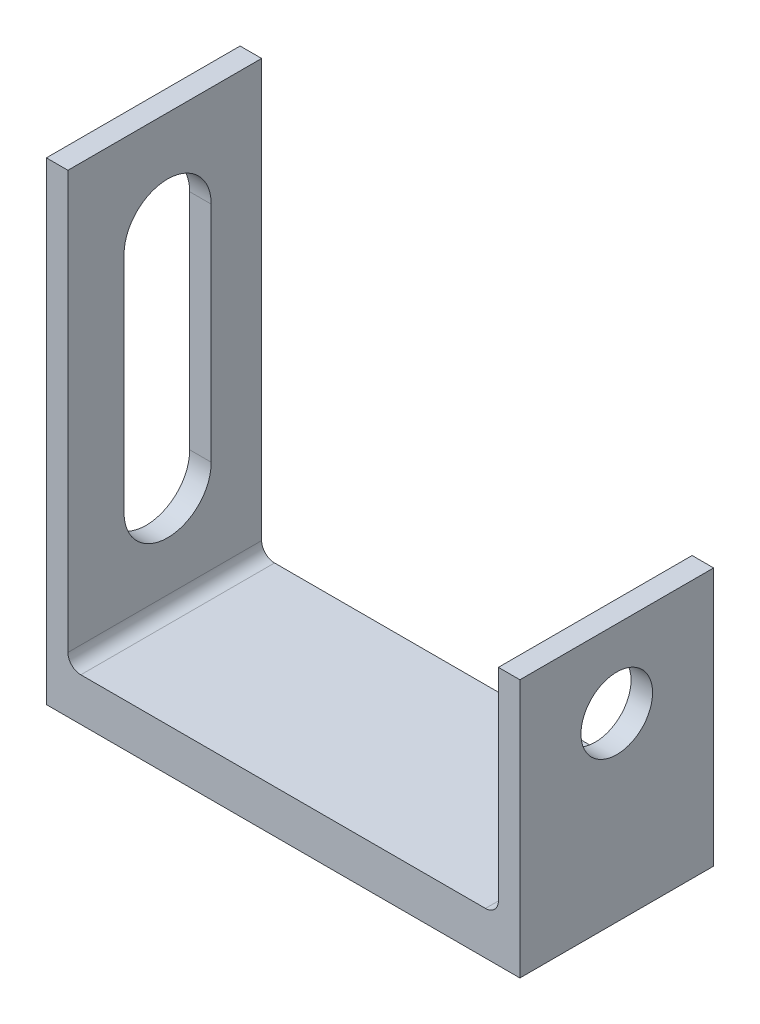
ISO-10303-21;
HEADER;
FILE_DESCRIPTION(('STEP AP214'),'2;1');
FILE_NAME('part.step','',(''),(''),'','','');
FILE_SCHEMA(('AUTOMOTIVE_DESIGN { 1 0 10303 214 1 1 1 1 }'));
ENDSEC;
DATA;
#1=APPLICATION_CONTEXT('core data for automotive mechanical design processes');
#2=APPLICATION_PROTOCOL_DEFINITION('international standard','automotive_design',2000,#1);
#3=PRODUCT_CONTEXT('',#1,'mechanical');
#4=PRODUCT('Part','Part','',(#3));
#5=PRODUCT_RELATED_PRODUCT_CATEGORY('part','',(#4));
#6=PRODUCT_DEFINITION_FORMATION('','',#4);
#7=PRODUCT_DEFINITION_CONTEXT('part definition',#1,'design');
#8=PRODUCT_DEFINITION('design','',#6,#7);
#9=PRODUCT_DEFINITION_SHAPE('','',#8);
#10=(LENGTH_UNIT() NAMED_UNIT(*) SI_UNIT(.MILLI.,.METRE.));
#11=(NAMED_UNIT(*) PLANE_ANGLE_UNIT() SI_UNIT($,.RADIAN.));
#12=(NAMED_UNIT(*) SI_UNIT($,.STERADIAN.) SOLID_ANGLE_UNIT());
#13=UNCERTAINTY_MEASURE_WITH_UNIT(LENGTH_MEASURE(1.E-05),#10,'distance_accuracy_value','');
#14=(GEOMETRIC_REPRESENTATION_CONTEXT(3) GLOBAL_UNCERTAINTY_ASSIGNED_CONTEXT((#13)) GLOBAL_UNIT_ASSIGNED_CONTEXT((#10,
#11,#12)) REPRESENTATION_CONTEXT('',''));
#15=CARTESIAN_POINT('',(0.,0.,0.));
#16=DIRECTION('',(0.,0.,1.));
#17=DIRECTION('',(1.,0.,0.));
#18=AXIS2_PLACEMENT_3D('',#15,#16,#17);
#19=CARTESIAN_POINT('',(0.,0.,0.));
#20=DIRECTION('',(0.,1.,0.));
#21=DIRECTION('',(0.,0.,1.));
#22=AXIS2_PLACEMENT_3D('',#19,#20,#21);
#23=PLANE('',#22);
#24=DIRECTION('',(1.,0.,0.));
#25=VECTOR('',#24,1.);
#26=CARTESIAN_POINT('',(0.,0.,0.));
#27=LINE('',#26,#25);
#28=CARTESIAN_POINT('',(8.00000000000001,0.,0.));
#29=VERTEX_POINT('',#28);
#30=CARTESIAN_POINT('',(102.,0.,0.));
#31=VERTEX_POINT('',#30);
#32=EDGE_CURVE('E211',#29,#31,#27,.T.);
#33=ORIENTED_EDGE('',*,*,#32,.T.);
#34=DIRECTION('',(0.,0.,1.));
#35=VECTOR('',#34,1.);
#36=CARTESIAN_POINT('',(102.,0.,0.));
#37=LINE('',#36,#35);
#38=CARTESIAN_POINT('',(102.,0.,-45.));
#39=VERTEX_POINT('',#38);
#40=EDGE_CURVE('E247',#31,#39,#37,.F.);
#41=ORIENTED_EDGE('',*,*,#40,.T.);
#42=DIRECTION('',(1.,0.,0.));
#43=VECTOR('',#42,1.);
#44=CARTESIAN_POINT('',(0.,0.,-45.));
#45=LINE('',#44,#43);
#46=CARTESIAN_POINT('',(8.,0.,-45.));
#47=VERTEX_POINT('',#46);
#48=EDGE_CURVE('E216',#47,#39,#45,.T.);
#49=ORIENTED_EDGE('',*,*,#48,.F.);
#50=DIRECTION('',(0.,0.,1.));
#51=VECTOR('',#50,1.);
#52=CARTESIAN_POINT('',(8.00000000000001,0.,0.));
#53=LINE('',#52,#51);
#54=EDGE_CURVE('E230',#47,#29,#53,.T.);
#55=ORIENTED_EDGE('',*,*,#54,.T.);
#56=EDGE_LOOP('',(#33,#41,#49,#55));
#57=FACE_BOUND('',#56,.T.);
#58=ADVANCED_FACE('F39',(#57),#23,.T.);
#59=CARTESIAN_POINT('',(0.,-10.,0.));
#60=DIRECTION('',(0.,0.,1.));
#61=DIRECTION('',(1.,0.,0.));
#62=AXIS2_PLACEMENT_3D('',#59,#60,#61);
#63=PLANE('',#62);
#64=ORIENTED_EDGE('',*,*,#32,.F.);
#65=CARTESIAN_POINT('',(8.00000000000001,3.,0.));
#66=DIRECTION('',(0.,0.,1.));
#67=DIRECTION('',(1.,0.,0.));
#68=AXIS2_PLACEMENT_3D('',#65,#66,#67);
#69=CIRCLE('',#68,3.);
#70=CARTESIAN_POINT('',(5.00000000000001,3.,0.));
#71=VERTEX_POINT('',#70);
#72=EDGE_CURVE('E240',#29,#71,#69,.F.);
#73=ORIENTED_EDGE('',*,*,#72,.T.);
#74=DIRECTION('',(0.,-1.,0.));
#75=VECTOR('',#74,1.);
#76=CARTESIAN_POINT('',(5.00000000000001,100.,0.));
#77=LINE('',#76,#75);
#78=CARTESIAN_POINT('',(5.00000000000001,100.,0.));
#79=VERTEX_POINT('',#78);
#80=EDGE_CURVE('E205',#79,#71,#77,.T.);
#81=ORIENTED_EDGE('',*,*,#80,.F.);
#82=DIRECTION('',(1.,0.,0.));
#83=VECTOR('',#82,1.);
#84=CARTESIAN_POINT('',(0.,100.,0.));
#85=LINE('',#84,#83);
#86=CARTESIAN_POINT('',(0.,100.,0.));
#87=VERTEX_POINT('',#86);
#88=EDGE_CURVE('E203',#87,#79,#85,.T.);
#89=ORIENTED_EDGE('',*,*,#88,.F.);
#90=DIRECTION('',(0.,1.,0.));
#91=VECTOR('',#90,1.);
#92=CARTESIAN_POINT('',(0.,-10.,0.));
#93=LINE('',#92,#91);
#94=CARTESIAN_POINT('',(0.,-10.,0.));
#95=VERTEX_POINT('',#94);
#96=EDGE_CURVE('E228',#95,#87,#93,.T.);
#97=ORIENTED_EDGE('',*,*,#96,.F.);
#98=DIRECTION('',(1.,0.,0.));
#99=VECTOR('',#98,1.);
#100=CARTESIAN_POINT('',(0.,-10.,0.));
#101=LINE('',#100,#99);
#102=CARTESIAN_POINT('',(110.,-10.,0.));
#103=VERTEX_POINT('',#102);
#104=EDGE_CURVE('E212',#95,#103,#101,.T.);
#105=ORIENTED_EDGE('',*,*,#104,.T.);
#106=DIRECTION('',(0.,1.,0.));
#107=VECTOR('',#106,1.);
#108=CARTESIAN_POINT('',(110.,-10.,0.));
#109=LINE('',#108,#107);
#110=CARTESIAN_POINT('',(110.,50.,0.));
#111=VERTEX_POINT('',#110);
#112=EDGE_CURVE('E223',#103,#111,#109,.T.);
#113=ORIENTED_EDGE('',*,*,#112,.T.);
#114=DIRECTION('',(1.,0.,0.));
#115=VECTOR('',#114,1.);
#116=CARTESIAN_POINT('',(0.,50.,0.));
#117=LINE('',#116,#115);
#118=CARTESIAN_POINT('',(105.,50.,0.));
#119=VERTEX_POINT('',#118);
#120=EDGE_CURVE('E182',#119,#111,#117,.T.);
#121=ORIENTED_EDGE('',*,*,#120,.F.);
#122=DIRECTION('',(0.,-1.,0.));
#123=VECTOR('',#122,1.);
#124=CARTESIAN_POINT('',(105.,50.,0.));
#125=LINE('',#124,#123);
#126=CARTESIAN_POINT('',(105.,3.,0.));
#127=VERTEX_POINT('',#126);
#128=EDGE_CURVE('E188',#119,#127,#125,.T.);
#129=ORIENTED_EDGE('',*,*,#128,.T.);
#130=CARTESIAN_POINT('',(102.,3.,0.));
#131=DIRECTION('',(0.,0.,1.));
#132=DIRECTION('',(1.,0.,0.));
#133=AXIS2_PLACEMENT_3D('',#130,#131,#132);
#134=CIRCLE('',#133,3.);
#135=EDGE_CURVE('E48',#127,#31,#134,.F.);
#136=ORIENTED_EDGE('',*,*,#135,.T.);
#137=EDGE_LOOP('',(#64,#73,#81,#89,#97,#105,#113,#121,#129,#136));
#138=FACE_BOUND('',#137,.T.);
#139=ADVANCED_FACE('F251',(#138),#63,.T.);
#140=CARTESIAN_POINT('',(0.,-10.,0.));
#141=DIRECTION('',(1.,0.,0.));
#142=DIRECTION('',(0.,0.,-1.));
#143=AXIS2_PLACEMENT_3D('',#140,#141,#142);
#144=PLANE('',#143);
#145=DIRECTION('',(0.,1.,0.));
#146=VECTOR('',#145,1.);
#147=CARTESIAN_POINT('',(0.,-10.,-33.298220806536));
#148=LINE('',#147,#146);
#149=CARTESIAN_POINT('',(0.,24.6106624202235,-33.298220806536));
#150=VERTEX_POINT('',#149);
#151=CARTESIAN_POINT('',(0.,76.5306624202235,-33.298220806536));
#152=VERTEX_POINT('',#151);
#153=EDGE_CURVE('E171',#150,#152,#148,.T.);
#154=ORIENTED_EDGE('',*,*,#153,.T.);
#155=CARTESIAN_POINT('',(0.,76.5306624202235,-23.1663311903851));
#156=DIRECTION('',(1.,0.,0.));
#157=DIRECTION('',(0.,0.,-1.));
#158=AXIS2_PLACEMENT_3D('',#155,#156,#157);
#159=CIRCLE('',#158,10.1318896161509);
#160=CARTESIAN_POINT('',(0.,76.5306624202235,-13.0344415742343));
#161=VERTEX_POINT('',#160);
#162=EDGE_CURVE('E174',#152,#161,#159,.T.);
#163=ORIENTED_EDGE('',*,*,#162,.T.);
#164=DIRECTION('',(0.,-1.,0.));
#165=VECTOR('',#164,1.);
#166=CARTESIAN_POINT('',(0.,-10.,-13.0344415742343));
#167=LINE('',#166,#165);
#168=CARTESIAN_POINT('',(0.,24.6106624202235,-13.0344415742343));
#169=VERTEX_POINT('',#168);
#170=EDGE_CURVE('E166',#161,#169,#167,.T.);
#171=ORIENTED_EDGE('',*,*,#170,.T.);
#172=CARTESIAN_POINT('',(0.,24.6106624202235,-23.1663311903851));
#173=DIRECTION('',(1.,0.,0.));
#174=DIRECTION('',(0.,0.,-1.));
#175=AXIS2_PLACEMENT_3D('',#172,#173,#174);
#176=CIRCLE('',#175,10.1318896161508);
#177=EDGE_CURVE('E146',#169,#150,#176,.T.);
#178=ORIENTED_EDGE('',*,*,#177,.T.);
#179=EDGE_LOOP('',(#154,#163,#171,#178));
#180=FACE_BOUND('',#179,.T.);
#181=ORIENTED_EDGE('',*,*,#96,.T.);
#182=DIRECTION('',(0.,0.,-1.));
#183=VECTOR('',#182,1.);
#184=CARTESIAN_POINT('',(0.,100.,0.));
#185=LINE('',#184,#183);
#186=CARTESIAN_POINT('',(0.,100.,-45.));
#187=VERTEX_POINT('',#186);
#188=EDGE_CURVE('E200',#87,#187,#185,.T.);
#189=ORIENTED_EDGE('',*,*,#188,.T.);
#190=DIRECTION('',(0.,1.,0.));
#191=VECTOR('',#190,1.);
#192=CARTESIAN_POINT('',(0.,-10.,-45.));
#193=LINE('',#192,#191);
#194=CARTESIAN_POINT('',(0.,-10.,-45.));
#195=VERTEX_POINT('',#194);
#196=EDGE_CURVE('E231',#195,#187,#193,.T.);
#197=ORIENTED_EDGE('',*,*,#196,.F.);
#198=DIRECTION('',(0.,0.,-1.));
#199=VECTOR('',#198,1.);
#200=CARTESIAN_POINT('',(0.,-10.,0.));
#201=LINE('',#200,#199);
#202=EDGE_CURVE('E221',#95,#195,#201,.T.);
#203=ORIENTED_EDGE('',*,*,#202,.F.);
#204=EDGE_LOOP('',(#181,#189,#197,#203));
#205=FACE_BOUND('',#204,.T.);
#206=ADVANCED_FACE('F284',(#180,#205),#144,.F.);
#207=CARTESIAN_POINT('',(0.,-10.,-45.));
#208=DIRECTION('',(0.,0.,1.));
#209=DIRECTION('',(1.,0.,0.));
#210=AXIS2_PLACEMENT_3D('',#207,#208,#209);
#211=PLANE('',#210);
#212=ORIENTED_EDGE('',*,*,#196,.T.);
#213=DIRECTION('',(1.,0.,0.));
#214=VECTOR('',#213,1.);
#215=CARTESIAN_POINT('',(0.,100.,-45.));
#216=LINE('',#215,#214);
#217=CARTESIAN_POINT('',(5.,100.,-45.));
#218=VERTEX_POINT('',#217);
#219=EDGE_CURVE('E197',#187,#218,#216,.T.);
#220=ORIENTED_EDGE('',*,*,#219,.T.);
#221=DIRECTION('',(0.,-1.,0.));
#222=VECTOR('',#221,1.);
#223=CARTESIAN_POINT('',(5.,100.,-45.));
#224=LINE('',#223,#222);
#225=CARTESIAN_POINT('',(5.,3.,-45.));
#226=VERTEX_POINT('',#225);
#227=EDGE_CURVE('E208',#218,#226,#224,.T.);
#228=ORIENTED_EDGE('',*,*,#227,.T.);
#229=CARTESIAN_POINT('',(8.,3.,-45.));
#230=DIRECTION('',(0.,0.,1.));
#231=DIRECTION('',(1.,0.,0.));
#232=AXIS2_PLACEMENT_3D('',#229,#230,#231);
#233=CIRCLE('',#232,3.);
#234=EDGE_CURVE('E242',#226,#47,#233,.T.);
#235=ORIENTED_EDGE('',*,*,#234,.T.);
#236=ORIENTED_EDGE('',*,*,#48,.T.);
#237=CARTESIAN_POINT('',(102.,3.,-45.));
#238=DIRECTION('',(0.,0.,1.));
#239=DIRECTION('',(1.,0.,0.));
#240=AXIS2_PLACEMENT_3D('',#237,#238,#239);
#241=CIRCLE('',#240,3.);
#242=CARTESIAN_POINT('',(105.,3.,-45.));
#243=VERTEX_POINT('',#242);
#244=EDGE_CURVE('E11',#39,#243,#241,.T.);
#245=ORIENTED_EDGE('',*,*,#244,.T.);
#246=DIRECTION('',(0.,-1.,0.));
#247=VECTOR('',#246,1.);
#248=CARTESIAN_POINT('',(105.,50.,-45.));
#249=LINE('',#248,#247);
#250=CARTESIAN_POINT('',(105.,50.,-45.));
#251=VERTEX_POINT('',#250);
#252=EDGE_CURVE('E191',#251,#243,#249,.T.);
#253=ORIENTED_EDGE('',*,*,#252,.F.);
#254=DIRECTION('',(1.,0.,0.));
#255=VECTOR('',#254,1.);
#256=CARTESIAN_POINT('',(0.,50.,-45.));
#257=LINE('',#256,#255);
#258=CARTESIAN_POINT('',(110.,50.,-45.));
#259=VERTEX_POINT('',#258);
#260=EDGE_CURVE('E177',#251,#259,#257,.T.);
#261=ORIENTED_EDGE('',*,*,#260,.T.);
#262=DIRECTION('',(0.,1.,0.));
#263=VECTOR('',#262,1.);
#264=CARTESIAN_POINT('',(110.,-10.,-45.));
#265=LINE('',#264,#263);
#266=CARTESIAN_POINT('',(110.,-10.,-45.));
#267=VERTEX_POINT('',#266);
#268=EDGE_CURVE('E233',#267,#259,#265,.T.);
#269=ORIENTED_EDGE('',*,*,#268,.F.);
#270=DIRECTION('',(1.,0.,0.));
#271=VECTOR('',#270,1.);
#272=CARTESIAN_POINT('',(0.,-10.,-45.));
#273=LINE('',#272,#271);
#274=EDGE_CURVE('E219',#195,#267,#273,.T.);
#275=ORIENTED_EDGE('',*,*,#274,.F.);
#276=EDGE_LOOP('',(#212,#220,#228,#235,#236,#245,#253,#261,#269,#275));
#277=FACE_BOUND('',#276,.T.);
#278=ADVANCED_FACE('F262',(#277),#211,.F.);
#279=CARTESIAN_POINT('',(110.,-10.,1.01770443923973E-13));
#280=DIRECTION('',(1.,0.,0.));
#281=DIRECTION('',(0.,0.,-1.));
#282=AXIS2_PLACEMENT_3D('',#279,#280,#281);
#283=PLANE('',#282);
#284=CARTESIAN_POINT('',(110.,32.0040260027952,-22.5));
#285=DIRECTION('',(1.,0.,0.));
#286=DIRECTION('',(0.,0.,-1.));
#287=AXIS2_PLACEMENT_3D('',#284,#285,#286);
#288=CIRCLE('',#287,8.315);
#289=CARTESIAN_POINT('',(110.,32.0040260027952,-30.815));
#290=VERTEX_POINT('',#289);
#291=EDGE_CURVE('E321',#290,#290,#288,.T.);
#292=ORIENTED_EDGE('',*,*,#291,.F.);
#293=EDGE_LOOP('',(#292));
#294=FACE_BOUND('',#293,.T.);
#295=ORIENTED_EDGE('',*,*,#268,.T.);
#296=DIRECTION('',(0.,0.,-1.));
#297=VECTOR('',#296,1.);
#298=CARTESIAN_POINT('',(110.,50.,1.01770443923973E-13));
#299=LINE('',#298,#297);
#300=EDGE_CURVE('E185',#111,#259,#299,.T.);
#301=ORIENTED_EDGE('',*,*,#300,.F.);
#302=ORIENTED_EDGE('',*,*,#112,.F.);
#303=DIRECTION('',(0.,0.,-1.));
#304=VECTOR('',#303,1.);
#305=CARTESIAN_POINT('',(110.,-10.,1.01770443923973E-13));
#306=LINE('',#305,#304);
#307=EDGE_CURVE('E215',#103,#267,#306,.T.);
#308=ORIENTED_EDGE('',*,*,#307,.T.);
#309=EDGE_LOOP('',(#295,#301,#302,#308));
#310=FACE_BOUND('',#309,.T.);
#311=ADVANCED_FACE('F274',(#294,#310),#283,.T.);
#312=CARTESIAN_POINT('',(0.,-10.,0.));
#313=DIRECTION('',(0.,1.,0.));
#314=DIRECTION('',(0.,0.,1.));
#315=AXIS2_PLACEMENT_3D('',#312,#313,#314);
#316=PLANE('',#315);
#317=ORIENTED_EDGE('',*,*,#104,.F.);
#318=ORIENTED_EDGE('',*,*,#202,.T.);
#319=ORIENTED_EDGE('',*,*,#274,.T.);
#320=ORIENTED_EDGE('',*,*,#307,.F.);
#321=EDGE_LOOP('',(#317,#318,#319,#320));
#322=FACE_BOUND('',#321,.T.);
#323=ADVANCED_FACE('F277',(#322),#316,.F.);
#324=CARTESIAN_POINT('',(5.00000000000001,100.,0.));
#325=DIRECTION('',(1.,0.,0.));
#326=DIRECTION('',(0.,0.,-1.));
#327=AXIS2_PLACEMENT_3D('',#324,#325,#326);
#328=PLANE('',#327);
#329=CARTESIAN_POINT('',(5.,76.5306624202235,-23.1663311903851));
#330=DIRECTION('',(1.,0.,0.));
#331=DIRECTION('',(0.,0.,-1.));
#332=AXIS2_PLACEMENT_3D('',#329,#330,#331);
#333=CIRCLE('',#332,10.1318896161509);
#334=CARTESIAN_POINT('',(5.,76.5306624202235,-33.298220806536));
#335=VERTEX_POINT('',#334);
#336=CARTESIAN_POINT('',(5.,76.5306624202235,-13.0344415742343));
#337=VERTEX_POINT('',#336);
#338=EDGE_CURVE('E63',#335,#337,#333,.T.);
#339=ORIENTED_EDGE('',*,*,#338,.F.);
#340=DIRECTION('',(0.,1.,0.));
#341=VECTOR('',#340,1.);
#342=CARTESIAN_POINT('',(5.,76.5306624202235,-33.298220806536));
#343=LINE('',#342,#341);
#344=CARTESIAN_POINT('',(5.,24.6106624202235,-33.298220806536));
#345=VERTEX_POINT('',#344);
#346=EDGE_CURVE('E159',#345,#335,#343,.T.);
#347=ORIENTED_EDGE('',*,*,#346,.F.);
#348=CARTESIAN_POINT('',(5.,24.6106624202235,-23.1663311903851));
#349=DIRECTION('',(1.,0.,0.));
#350=DIRECTION('',(0.,0.,-1.));
#351=AXIS2_PLACEMENT_3D('',#348,#349,#350);
#352=CIRCLE('',#351,10.1318896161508);
#353=CARTESIAN_POINT('',(5.,24.6106624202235,-13.0344415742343));
#354=VERTEX_POINT('',#353);
#355=EDGE_CURVE('E143',#354,#345,#352,.T.);
#356=ORIENTED_EDGE('',*,*,#355,.F.);
#357=DIRECTION('',(0.,-1.,0.));
#358=VECTOR('',#357,1.);
#359=CARTESIAN_POINT('',(5.,76.5306624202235,-13.0344415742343));
#360=LINE('',#359,#358);
#361=EDGE_CURVE('E152',#337,#354,#360,.T.);
#362=ORIENTED_EDGE('',*,*,#361,.F.);
#363=EDGE_LOOP('',(#339,#347,#356,#362));
#364=FACE_BOUND('',#363,.T.);
#365=ORIENTED_EDGE('',*,*,#80,.T.);
#366=DIRECTION('',(0.,0.,1.));
#367=VECTOR('',#366,1.);
#368=CARTESIAN_POINT('',(5.,3.,-45.));
#369=LINE('',#368,#367);
#370=EDGE_CURVE('E238',#71,#226,#369,.F.);
#371=ORIENTED_EDGE('',*,*,#370,.T.);
#372=ORIENTED_EDGE('',*,*,#227,.F.);
#373=DIRECTION('',(0.,0.,1.));
#374=VECTOR('',#373,1.);
#375=CARTESIAN_POINT('',(5.00000000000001,100.,0.));
#376=LINE('',#375,#374);
#377=EDGE_CURVE('E194',#218,#79,#376,.T.);
#378=ORIENTED_EDGE('',*,*,#377,.T.);
#379=EDGE_LOOP('',(#365,#371,#372,#378));
#380=FACE_BOUND('',#379,.T.);
#381=ADVANCED_FACE('F156',(#364,#380),#328,.T.);
#382=CARTESIAN_POINT('',(0.,100.,0.));
#383=DIRECTION('',(0.,1.,0.));
#384=DIRECTION('',(0.,0.,1.));
#385=AXIS2_PLACEMENT_3D('',#382,#383,#384);
#386=PLANE('',#385);
#387=ORIENTED_EDGE('',*,*,#377,.F.);
#388=ORIENTED_EDGE('',*,*,#219,.F.);
#389=ORIENTED_EDGE('',*,*,#188,.F.);
#390=ORIENTED_EDGE('',*,*,#88,.T.);
#391=EDGE_LOOP('',(#387,#388,#389,#390));
#392=FACE_BOUND('',#391,.T.);
#393=ADVANCED_FACE('F288',(#392),#386,.T.);
#394=CARTESIAN_POINT('',(105.,50.,0.));
#395=DIRECTION('',(1.,0.,0.));
#396=DIRECTION('',(0.,0.,-1.));
#397=AXIS2_PLACEMENT_3D('',#394,#395,#396);
#398=PLANE('',#397);
#399=CARTESIAN_POINT('',(105.,32.0040260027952,-22.5));
#400=DIRECTION('',(1.,0.,0.));
#401=DIRECTION('',(0.,0.,-1.));
#402=AXIS2_PLACEMENT_3D('',#399,#400,#401);
#403=CIRCLE('',#402,8.315);
#404=CARTESIAN_POINT('',(105.,32.0040260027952,-30.815));
#405=VERTEX_POINT('',#404);
#406=EDGE_CURVE('E43',#405,#405,#403,.T.);
#407=ORIENTED_EDGE('',*,*,#406,.T.);
#408=EDGE_LOOP('',(#407));
#409=FACE_BOUND('',#408,.T.);
#410=ORIENTED_EDGE('',*,*,#252,.T.);
#411=DIRECTION('',(0.,0.,1.));
#412=VECTOR('',#411,1.);
#413=CARTESIAN_POINT('',(105.,3.,0.));
#414=LINE('',#413,#412);
#415=EDGE_CURVE('E244',#243,#127,#414,.T.);
#416=ORIENTED_EDGE('',*,*,#415,.T.);
#417=ORIENTED_EDGE('',*,*,#128,.F.);
#418=DIRECTION('',(0.,0.,1.));
#419=VECTOR('',#418,1.);
#420=CARTESIAN_POINT('',(105.,50.,0.));
#421=LINE('',#420,#419);
#422=EDGE_CURVE('E180',#251,#119,#421,.T.);
#423=ORIENTED_EDGE('',*,*,#422,.F.);
#424=EDGE_LOOP('',(#410,#416,#417,#423));
#425=FACE_BOUND('',#424,.T.);
#426=ADVANCED_FACE('F265',(#409,#425),#398,.F.);
#427=CARTESIAN_POINT('',(0.,50.,0.));
#428=DIRECTION('',(0.,1.,0.));
#429=DIRECTION('',(0.,0.,1.));
#430=AXIS2_PLACEMENT_3D('',#427,#428,#429);
#431=PLANE('',#430);
#432=ORIENTED_EDGE('',*,*,#260,.F.);
#433=ORIENTED_EDGE('',*,*,#422,.T.);
#434=ORIENTED_EDGE('',*,*,#120,.T.);
#435=ORIENTED_EDGE('',*,*,#300,.T.);
#436=EDGE_LOOP('',(#432,#433,#434,#435));
#437=FACE_BOUND('',#436,.T.);
#438=ADVANCED_FACE('F268',(#437),#431,.T.);
#439=CARTESIAN_POINT('',(8.00000000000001,3.,0.));
#440=DIRECTION('',(0.,0.,-1.));
#441=DIRECTION('',(-1.,0.,0.));
#442=AXIS2_PLACEMENT_3D('',#439,#440,#441);
#443=CYLINDRICAL_SURFACE('',#442,3.);
#444=ORIENTED_EDGE('',*,*,#234,.F.);
#445=ORIENTED_EDGE('',*,*,#370,.F.);
#446=ORIENTED_EDGE('',*,*,#72,.F.);
#447=ORIENTED_EDGE('',*,*,#54,.F.);
#448=EDGE_LOOP('',(#444,#445,#446,#447));
#449=FACE_BOUND('',#448,.T.);
#450=ADVANCED_FACE('F292',(#449),#443,.F.);
#451=CARTESIAN_POINT('',(102.,3.,0.));
#452=DIRECTION('',(0.,0.,1.));
#453=DIRECTION('',(1.,0.,0.));
#454=AXIS2_PLACEMENT_3D('',#451,#452,#453);
#455=CYLINDRICAL_SURFACE('',#454,3.);
#456=ORIENTED_EDGE('',*,*,#244,.F.);
#457=ORIENTED_EDGE('',*,*,#40,.F.);
#458=ORIENTED_EDGE('',*,*,#135,.F.);
#459=ORIENTED_EDGE('',*,*,#415,.F.);
#460=EDGE_LOOP('',(#456,#457,#458,#459));
#461=FACE_BOUND('',#460,.T.);
#462=ADVANCED_FACE('F41',(#461),#455,.F.);
#463=CARTESIAN_POINT('',(-35.,76.5306624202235,-23.1663311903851));
#464=DIRECTION('',(1.,0.,0.));
#465=DIRECTION('',(0.,0.,-1.));
#466=AXIS2_PLACEMENT_3D('',#463,#464,#465);
#467=CYLINDRICAL_SURFACE('',#466,10.1318896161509);
#468=DIRECTION('',(1.,0.,0.));
#469=VECTOR('',#468,1.);
#470=CARTESIAN_POINT('',(-35.,76.5306624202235,-33.298220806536));
#471=LINE('',#470,#469);
#472=EDGE_CURVE('E164',#152,#335,#471,.T.);
#473=ORIENTED_EDGE('',*,*,#472,.T.);
#474=ORIENTED_EDGE('',*,*,#338,.T.);
#475=DIRECTION('',(1.,0.,0.));
#476=VECTOR('',#475,1.);
#477=CARTESIAN_POINT('',(-35.,76.5306624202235,-13.0344415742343));
#478=LINE('',#477,#476);
#479=EDGE_CURVE('E149',#161,#337,#478,.T.);
#480=ORIENTED_EDGE('',*,*,#479,.F.);
#481=ORIENTED_EDGE('',*,*,#162,.F.);
#482=EDGE_LOOP('',(#473,#474,#480,#481));
#483=FACE_BOUND('',#482,.T.);
#484=ADVANCED_FACE('F298',(#483),#467,.F.);
#485=CARTESIAN_POINT('',(-35.,76.5306624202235,-33.298220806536));
#486=DIRECTION('',(0.,0.,-1.));
#487=DIRECTION('',(-1.,0.,0.));
#488=AXIS2_PLACEMENT_3D('',#485,#486,#487);
#489=PLANE('',#488);
#490=DIRECTION('',(1.,0.,0.));
#491=VECTOR('',#490,1.);
#492=CARTESIAN_POINT('',(-35.,24.6106624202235,-33.298220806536));
#493=LINE('',#492,#491);
#494=EDGE_CURVE('E148',#150,#345,#493,.T.);
#495=ORIENTED_EDGE('',*,*,#494,.T.);
#496=ORIENTED_EDGE('',*,*,#346,.T.);
#497=ORIENTED_EDGE('',*,*,#472,.F.);
#498=ORIENTED_EDGE('',*,*,#153,.F.);
#499=EDGE_LOOP('',(#495,#496,#497,#498));
#500=FACE_BOUND('',#499,.T.);
#501=ADVANCED_FACE('F336',(#500),#489,.F.);
#502=CARTESIAN_POINT('',(-35.,24.6106624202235,-23.1663311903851));
#503=DIRECTION('',(1.,0.,0.));
#504=DIRECTION('',(0.,0.,-1.));
#505=AXIS2_PLACEMENT_3D('',#502,#503,#504);
#506=CYLINDRICAL_SURFACE('',#505,10.1318896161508);
#507=DIRECTION('',(1.,0.,0.));
#508=VECTOR('',#507,1.);
#509=CARTESIAN_POINT('',(-35.,24.6106624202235,-13.0344415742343));
#510=LINE('',#509,#508);
#511=EDGE_CURVE('E55',#169,#354,#510,.T.);
#512=ORIENTED_EDGE('',*,*,#511,.T.);
#513=ORIENTED_EDGE('',*,*,#355,.T.);
#514=ORIENTED_EDGE('',*,*,#494,.F.);
#515=ORIENTED_EDGE('',*,*,#177,.F.);
#516=EDGE_LOOP('',(#512,#513,#514,#515));
#517=FACE_BOUND('',#516,.T.);
#518=ADVANCED_FACE('F140',(#517),#506,.F.);
#519=CARTESIAN_POINT('',(-35.,76.5306624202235,-13.0344415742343));
#520=DIRECTION('',(0.,0.,1.));
#521=DIRECTION('',(0.,-1.,0.));
#522=AXIS2_PLACEMENT_3D('',#519,#520,#521);
#523=PLANE('',#522);
#524=ORIENTED_EDGE('',*,*,#479,.T.);
#525=ORIENTED_EDGE('',*,*,#361,.T.);
#526=ORIENTED_EDGE('',*,*,#511,.F.);
#527=ORIENTED_EDGE('',*,*,#170,.F.);
#528=EDGE_LOOP('',(#524,#525,#526,#527));
#529=FACE_BOUND('',#528,.T.);
#530=ADVANCED_FACE('F153',(#529),#523,.F.);
#531=CARTESIAN_POINT('',(70.,32.0040260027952,-22.5));
#532=DIRECTION('',(1.,0.,0.));
#533=DIRECTION('',(0.,0.,-1.));
#534=AXIS2_PLACEMENT_3D('',#531,#532,#533);
#535=CYLINDRICAL_SURFACE('',#534,8.315);
#536=ORIENTED_EDGE('',*,*,#291,.T.);
#537=EDGE_LOOP('',(#536));
#538=FACE_BOUND('',#537,.T.);
#539=ORIENTED_EDGE('',*,*,#406,.F.);
#540=EDGE_LOOP('',(#539));
#541=FACE_BOUND('',#540,.T.);
#542=ADVANCED_FACE('F328',(#538,#541),#535,.F.);
#543=CLOSED_SHELL('',(#58,#139,#206,#278,#311,#323,#381,#393,#426,#438,#450,#462,#484,#501,#518,
#530,#542));
#544=MANIFOLD_SOLID_BREP('B2',#543);
#545=ADVANCED_BREP_SHAPE_REPRESENTATION('',(#18,#544),#14);
#546=SHAPE_DEFINITION_REPRESENTATION(#9,#545);
ENDSEC;
END-ISO-10303-21;
